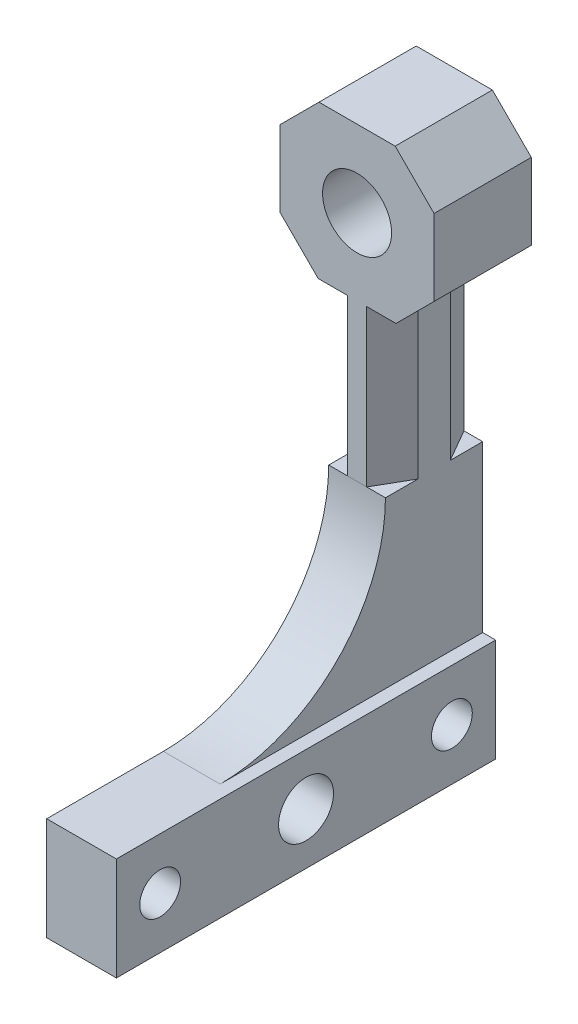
ISO-10303-21;
HEADER;
FILE_DESCRIPTION(('STEP AP214'),'2;1');
FILE_NAME('part.step','',(''),(''),'','','');
FILE_SCHEMA(('AUTOMOTIVE_DESIGN { 1 0 10303 214 1 1 1 1 }'));
ENDSEC;
DATA;
#1=APPLICATION_CONTEXT('core data for automotive mechanical design processes');
#2=APPLICATION_PROTOCOL_DEFINITION('international standard','automotive_design',2000,#1);
#3=PRODUCT_CONTEXT('',#1,'mechanical');
#4=PRODUCT('Part','Part','',(#3));
#5=PRODUCT_RELATED_PRODUCT_CATEGORY('part','',(#4));
#6=PRODUCT_DEFINITION_FORMATION('','',#4);
#7=PRODUCT_DEFINITION_CONTEXT('part definition',#1,'design');
#8=PRODUCT_DEFINITION('design','',#6,#7);
#9=PRODUCT_DEFINITION_SHAPE('','',#8);
#10=(LENGTH_UNIT() NAMED_UNIT(*) SI_UNIT(.MILLI.,.METRE.));
#11=(NAMED_UNIT(*) PLANE_ANGLE_UNIT() SI_UNIT($,.RADIAN.));
#12=(NAMED_UNIT(*) SI_UNIT($,.STERADIAN.) SOLID_ANGLE_UNIT());
#13=UNCERTAINTY_MEASURE_WITH_UNIT(LENGTH_MEASURE(1.E-05),#10,'distance_accuracy_value','');
#14=(GEOMETRIC_REPRESENTATION_CONTEXT(3) GLOBAL_UNCERTAINTY_ASSIGNED_CONTEXT((#13)) GLOBAL_UNIT_ASSIGNED_CONTEXT((#10,
#11,#12)) REPRESENTATION_CONTEXT('',''));
#15=CARTESIAN_POINT('',(0.,0.,0.));
#16=DIRECTION('',(0.,0.,1.));
#17=DIRECTION('',(1.,0.,0.));
#18=AXIS2_PLACEMENT_3D('',#15,#16,#17);
#19=CARTESIAN_POINT('',(2.2225,-31.1658,7.61999999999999));
#20=DIRECTION('',(-1.,0.,0.));
#21=DIRECTION('',(0.,-1.,0.));
#22=AXIS2_PLACEMENT_3D('',#19,#20,#21);
#23=PLANE('',#22);
#24=DIRECTION('',(0.,1.,0.));
#25=VECTOR('',#24,1.);
#26=CARTESIAN_POINT('',(2.2225,-18.2118,2.53999999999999));
#27=LINE('',#26,#25);
#28=CARTESIAN_POINT('',(2.2225,-18.2118,2.53999999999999));
#29=VERTEX_POINT('',#28);
#30=CARTESIAN_POINT('',(2.2225,-5.969,2.53999999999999));
#31=VERTEX_POINT('',#30);
#32=EDGE_CURVE('E236',#29,#31,#27,.T.);
#33=ORIENTED_EDGE('',*,*,#32,.T.);
#34=DIRECTION('',(0.,0.,-1.));
#35=VECTOR('',#34,1.);
#36=CARTESIAN_POINT('',(2.2225,-5.969,2.53999999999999));
#37=LINE('',#36,#35);
#38=CARTESIAN_POINT('',(2.2225,-5.969,5.08));
#39=VERTEX_POINT('',#38);
#40=EDGE_CURVE('E241',#39,#31,#37,.T.);
#41=ORIENTED_EDGE('',*,*,#40,.F.);
#42=DIRECTION('',(0.,1.,0.));
#43=VECTOR('',#42,1.);
#44=CARTESIAN_POINT('',(2.2225,-18.2118,5.08));
#45=LINE('',#44,#43);
#46=CARTESIAN_POINT('',(2.2225,-18.2118,5.08));
#47=VERTEX_POINT('',#46);
#48=EDGE_CURVE('E225',#47,#39,#45,.T.);
#49=ORIENTED_EDGE('',*,*,#48,.F.);
#50=DIRECTION('',(0.,0.,-1.));
#51=VECTOR('',#50,1.);
#52=CARTESIAN_POINT('',(2.2225,-18.2118,7.61999999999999));
#53=LINE('',#52,#51);
#54=CARTESIAN_POINT('',(2.2225,-18.2118,7.62000000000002));
#55=VERTEX_POINT('',#54);
#56=EDGE_CURVE('E288',#55,#47,#53,.T.);
#57=ORIENTED_EDGE('',*,*,#56,.F.);
#58=CARTESIAN_POINT('',(2.2225,-18.2118,20.574));
#59=DIRECTION('',(-1.,0.,0.));
#60=DIRECTION('',(0.,-1.,0.));
#61=AXIS2_PLACEMENT_3D('',#58,#59,#60);
#62=CIRCLE('',#61,12.954);
#63=CARTESIAN_POINT('',(2.2225,-31.1658,20.574));
#64=VERTEX_POINT('',#63);
#65=EDGE_CURVE('E343',#55,#64,#62,.T.);
#66=ORIENTED_EDGE('',*,*,#65,.T.);
#67=DIRECTION('',(0.,0.,1.));
#68=VECTOR('',#67,1.);
#69=CARTESIAN_POINT('',(2.2225,-31.1658,29.718));
#70=LINE('',#69,#68);
#71=CARTESIAN_POINT('',(2.2225,-31.1658,0.));
#72=VERTEX_POINT('',#71);
#73=EDGE_CURVE('E321',#72,#64,#70,.T.);
#74=ORIENTED_EDGE('',*,*,#73,.F.);
#75=DIRECTION('',(0.,1.,0.));
#76=VECTOR('',#75,1.);
#77=CARTESIAN_POINT('',(2.2225,-31.1658,0.));
#78=LINE('',#77,#76);
#79=CARTESIAN_POINT('',(2.2225,-18.2118,0.));
#80=VERTEX_POINT('',#79);
#81=EDGE_CURVE('E399',#72,#80,#78,.T.);
#82=ORIENTED_EDGE('',*,*,#81,.T.);
#83=EDGE_CURVE('E291',#29,#80,#53,.T.);
#84=ORIENTED_EDGE('',*,*,#83,.F.);
#85=EDGE_LOOP('',(#33,#41,#49,#57,#66,#74,#82,#84));
#86=FACE_BOUND('',#85,.T.);
#87=ADVANCED_FACE('F69',(#86),#23,.F.);
#88=CARTESIAN_POINT('',(-2.2225,-6.0325,7.61999999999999));
#89=DIRECTION('',(1.,0.,0.));
#90=DIRECTION('',(0.,1.,0.));
#91=AXIS2_PLACEMENT_3D('',#88,#89,#90);
#92=PLANE('',#91);
#93=DIRECTION('',(0.,1.,0.));
#94=VECTOR('',#93,1.);
#95=CARTESIAN_POINT('',(-2.2225,-18.2118,5.08));
#96=LINE('',#95,#94);
#97=CARTESIAN_POINT('',(-2.2225,-18.2118,5.08));
#98=VERTEX_POINT('',#97);
#99=CARTESIAN_POINT('',(-2.2225,-5.969,5.08));
#100=VERTEX_POINT('',#99);
#101=EDGE_CURVE('E272',#98,#100,#96,.T.);
#102=ORIENTED_EDGE('',*,*,#101,.T.);
#103=DIRECTION('',(0.,0.,1.));
#104=VECTOR('',#103,1.);
#105=CARTESIAN_POINT('',(-2.2225,-5.969,5.08));
#106=LINE('',#105,#104);
#107=CARTESIAN_POINT('',(-2.2225,-5.969,2.53999999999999));
#108=VERTEX_POINT('',#107);
#109=EDGE_CURVE('E254',#108,#100,#106,.T.);
#110=ORIENTED_EDGE('',*,*,#109,.F.);
#111=DIRECTION('',(0.,1.,0.));
#112=VECTOR('',#111,1.);
#113=CARTESIAN_POINT('',(-2.2225,-18.2118,2.54000000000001));
#114=LINE('',#113,#112);
#115=CARTESIAN_POINT('',(-2.2225,-18.2118,2.54000000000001));
#116=VERTEX_POINT('',#115);
#117=EDGE_CURVE('E274',#116,#108,#114,.T.);
#118=ORIENTED_EDGE('',*,*,#117,.F.);
#119=DIRECTION('',(0.,0.,1.));
#120=VECTOR('',#119,1.);
#121=CARTESIAN_POINT('',(-2.2225,-18.2118,7.61999999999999));
#122=LINE('',#121,#120);
#123=CARTESIAN_POINT('',(-2.2225,-18.2118,0.));
#124=VERTEX_POINT('',#123);
#125=EDGE_CURVE('E294',#124,#116,#122,.T.);
#126=ORIENTED_EDGE('',*,*,#125,.F.);
#127=DIRECTION('',(0.,-1.,0.));
#128=VECTOR('',#127,1.);
#129=CARTESIAN_POINT('',(-2.2225,-6.0325,0.));
#130=LINE('',#129,#128);
#131=CARTESIAN_POINT('',(-2.2225,-39.243,0.));
#132=VERTEX_POINT('',#131);
#133=EDGE_CURVE('E396',#124,#132,#130,.T.);
#134=ORIENTED_EDGE('',*,*,#133,.T.);
#135=DIRECTION('',(0.,0.,-1.));
#136=VECTOR('',#135,1.);
#137=CARTESIAN_POINT('',(-2.2225,-39.243,29.718));
#138=LINE('',#137,#136);
#139=CARTESIAN_POINT('',(-2.2225,-39.243,29.718));
#140=VERTEX_POINT('',#139);
#141=EDGE_CURVE('E572',#140,#132,#138,.T.);
#142=ORIENTED_EDGE('',*,*,#141,.F.);
#143=DIRECTION('',(0.,-1.,0.));
#144=VECTOR('',#143,1.);
#145=CARTESIAN_POINT('',(-2.2225,-31.1658,29.718));
#146=LINE('',#145,#144);
#147=CARTESIAN_POINT('',(-2.2225,-31.1658,29.718));
#148=VERTEX_POINT('',#147);
#149=EDGE_CURVE('E333',#148,#140,#146,.T.);
#150=ORIENTED_EDGE('',*,*,#149,.F.);
#151=DIRECTION('',(0.,0.,1.));
#152=VECTOR('',#151,1.);
#153=CARTESIAN_POINT('',(-2.2225,-31.1658,29.718));
#154=LINE('',#153,#152);
#155=CARTESIAN_POINT('',(-2.2225,-31.1658,20.574));
#156=VERTEX_POINT('',#155);
#157=EDGE_CURVE('E336',#156,#148,#154,.T.);
#158=ORIENTED_EDGE('',*,*,#157,.F.);
#159=CARTESIAN_POINT('',(-2.2225,-18.2118,20.574));
#160=DIRECTION('',(1.,0.,0.));
#161=DIRECTION('',(0.,1.,0.));
#162=AXIS2_PLACEMENT_3D('',#159,#160,#161);
#163=CIRCLE('',#162,12.954);
#164=CARTESIAN_POINT('',(-2.2225,-18.2118,7.62000000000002));
#165=VERTEX_POINT('',#164);
#166=EDGE_CURVE('E346',#156,#165,#163,.T.);
#167=ORIENTED_EDGE('',*,*,#166,.T.);
#168=EDGE_CURVE('E290',#98,#165,#122,.T.);
#169=ORIENTED_EDGE('',*,*,#168,.F.);
#170=EDGE_LOOP('',(#102,#110,#118,#126,#134,#142,#150,#158,#167,#169));
#171=FACE_BOUND('',#170,.T.);
#172=CARTESIAN_POINT('',(-2.2225,-35.2044,26.289));
#173=DIRECTION('',(1.,0.,0.));
#174=DIRECTION('',(0.,1.,0.));
#175=AXIS2_PLACEMENT_3D('',#172,#173,#174);
#176=CIRCLE('',#175,1.6002);
#177=CARTESIAN_POINT('',(-2.2225,-33.6042,26.289));
#178=VERTEX_POINT('',#177);
#179=EDGE_CURVE('E300',#178,#178,#176,.T.);
#180=ORIENTED_EDGE('',*,*,#179,.T.);
#181=EDGE_LOOP('',(#180));
#182=FACE_BOUND('',#181,.T.);
#183=CARTESIAN_POINT('',(-2.2225,-35.2044,3.42900000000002));
#184=DIRECTION('',(1.,0.,0.));
#185=DIRECTION('',(0.,1.,0.));
#186=AXIS2_PLACEMENT_3D('',#183,#184,#185);
#187=CIRCLE('',#186,1.6002);
#188=CARTESIAN_POINT('',(-2.2225,-33.6042,3.42900000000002));
#189=VERTEX_POINT('',#188);
#190=EDGE_CURVE('E306',#189,#189,#187,.T.);
#191=ORIENTED_EDGE('',*,*,#190,.T.);
#192=EDGE_LOOP('',(#191));
#193=FACE_BOUND('',#192,.T.);
#194=CARTESIAN_POINT('',(-2.2225,-35.2044,14.859));
#195=DIRECTION('',(1.,0.,0.));
#196=DIRECTION('',(0.,1.,0.));
#197=AXIS2_PLACEMENT_3D('',#194,#195,#196);
#198=CIRCLE('',#197,2.15265);
#199=CARTESIAN_POINT('',(-2.2225,-33.05175,14.859));
#200=VERTEX_POINT('',#199);
#201=EDGE_CURVE('E318',#200,#200,#198,.T.);
#202=ORIENTED_EDGE('',*,*,#201,.T.);
#203=EDGE_LOOP('',(#202));
#204=FACE_BOUND('',#203,.T.);
#205=ADVANCED_FACE('F461',(#171,#182,#193,#204),#92,.F.);
#206=CARTESIAN_POINT('',(-6.0325,6.0325,0.));
#207=DIRECTION('',(0.,0.,1.));
#208=DIRECTION('',(1.,0.,0.));
#209=AXIS2_PLACEMENT_3D('',#206,#207,#208);
#210=PLANE('',#209);
#211=DIRECTION('',(0.,1.,0.));
#212=VECTOR('',#211,1.);
#213=CARTESIAN_POINT('',(-0.756030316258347,-18.2118,0.));
#214=LINE('',#213,#212);
#215=CARTESIAN_POINT('',(-0.756030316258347,-18.2118,0.));
#216=VERTEX_POINT('',#215);
#217=CARTESIAN_POINT('',(-0.756030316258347,-5.969,0.));
#218=VERTEX_POINT('',#217);
#219=EDGE_CURVE('E276',#216,#218,#214,.T.);
#220=ORIENTED_EDGE('',*,*,#219,.T.);
#221=DIRECTION('',(-1.,0.,0.));
#222=VECTOR('',#221,1.);
#223=CARTESIAN_POINT('',(-6.0325,-5.969,0.));
#224=LINE('',#223,#222);
#225=CARTESIAN_POINT('',(-3.048,-5.969,0.));
#226=VERTEX_POINT('',#225);
#227=EDGE_CURVE('E271',#218,#226,#224,.T.);
#228=ORIENTED_EDGE('',*,*,#227,.T.);
#229=DIRECTION('',(0.707106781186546,-0.707106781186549,0.));
#230=VECTOR('',#229,1.);
#231=CARTESIAN_POINT('',(-2.9845,-6.0325,0.));
#232=LINE('',#231,#230);
#233=CARTESIAN_POINT('',(-6.0325,-2.98449999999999,0.));
#234=VERTEX_POINT('',#233);
#235=EDGE_CURVE('E354',#226,#234,#232,.F.);
#236=ORIENTED_EDGE('',*,*,#235,.T.);
#237=DIRECTION('',(0.,-1.,0.));
#238=VECTOR('',#237,1.);
#239=CARTESIAN_POINT('',(-6.0325,6.0325,0.));
#240=LINE('',#239,#238);
#241=CARTESIAN_POINT('',(-6.0325,2.9845,0.));
#242=VERTEX_POINT('',#241);
#243=EDGE_CURVE('E384',#242,#234,#240,.T.);
#244=ORIENTED_EDGE('',*,*,#243,.F.);
#245=DIRECTION('',(-0.707106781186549,-0.707106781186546,0.));
#246=VECTOR('',#245,1.);
#247=CARTESIAN_POINT('',(-6.0325,2.9845,0.));
#248=LINE('',#247,#246);
#249=CARTESIAN_POINT('',(-2.98449999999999,6.0325,0.));
#250=VERTEX_POINT('',#249);
#251=EDGE_CURVE('E356',#242,#250,#248,.F.);
#252=ORIENTED_EDGE('',*,*,#251,.T.);
#253=DIRECTION('',(-1.,0.,0.));
#254=VECTOR('',#253,1.);
#255=CARTESIAN_POINT('',(-6.0325,6.0325,0.));
#256=LINE('',#255,#254);
#257=CARTESIAN_POINT('',(2.9845,6.0325,0.));
#258=VERTEX_POINT('',#257);
#259=EDGE_CURVE('E411',#258,#250,#256,.T.);
#260=ORIENTED_EDGE('',*,*,#259,.F.);
#261=DIRECTION('',(-0.707106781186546,0.707106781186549,0.));
#262=VECTOR('',#261,1.);
#263=CARTESIAN_POINT('',(2.9845,6.0325,0.));
#264=LINE('',#263,#262);
#265=CARTESIAN_POINT('',(6.0325,2.98449999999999,0.));
#266=VERTEX_POINT('',#265);
#267=EDGE_CURVE('E358',#258,#266,#264,.F.);
#268=ORIENTED_EDGE('',*,*,#267,.T.);
#269=DIRECTION('',(0.,1.,0.));
#270=VECTOR('',#269,1.);
#271=CARTESIAN_POINT('',(6.0325,6.0325,0.));
#272=LINE('',#271,#270);
#273=CARTESIAN_POINT('',(6.0325,-2.9845,0.));
#274=VERTEX_POINT('',#273);
#275=EDGE_CURVE('E408',#274,#266,#272,.T.);
#276=ORIENTED_EDGE('',*,*,#275,.F.);
#277=DIRECTION('',(0.707106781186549,0.707106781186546,0.));
#278=VECTOR('',#277,1.);
#279=CARTESIAN_POINT('',(6.0325,-2.9845,0.));
#280=LINE('',#279,#278);
#281=CARTESIAN_POINT('',(3.04799999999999,-5.969,0.));
#282=VERTEX_POINT('',#281);
#283=EDGE_CURVE('E360',#274,#282,#280,.F.);
#284=ORIENTED_EDGE('',*,*,#283,.T.);
#285=CARTESIAN_POINT('',(0.75603031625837,-5.969,0.));
#286=VERTEX_POINT('',#285);
#287=EDGE_CURVE('E84',#282,#286,#224,.T.);
#288=ORIENTED_EDGE('',*,*,#287,.T.);
#289=DIRECTION('',(0.,1.,0.));
#290=VECTOR('',#289,1.);
#291=CARTESIAN_POINT('',(0.75603031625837,-18.2118,0.));
#292=LINE('',#291,#290);
#293=CARTESIAN_POINT('',(0.75603031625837,-18.2118,0.));
#294=VERTEX_POINT('',#293);
#295=EDGE_CURVE('E279',#294,#286,#292,.T.);
#296=ORIENTED_EDGE('',*,*,#295,.F.);
#297=DIRECTION('',(-1.,0.,0.));
#298=VECTOR('',#297,1.);
#299=CARTESIAN_POINT('',(-6.0325,-18.2118,0.));
#300=LINE('',#299,#298);
#301=EDGE_CURVE('E296',#80,#294,#300,.T.);
#302=ORIENTED_EDGE('',*,*,#301,.F.);
#303=ORIENTED_EDGE('',*,*,#81,.F.);
#304=DIRECTION('',(-1.,0.,0.));
#305=VECTOR('',#304,1.);
#306=CARTESIAN_POINT('',(3.2385,-31.1658,0.));
#307=LINE('',#306,#305);
#308=CARTESIAN_POINT('',(3.2385,-31.1658,0.));
#309=VERTEX_POINT('',#308);
#310=EDGE_CURVE('E329',#309,#72,#307,.T.);
#311=ORIENTED_EDGE('',*,*,#310,.F.);
#312=DIRECTION('',(0.,1.,0.));
#313=VECTOR('',#312,1.);
#314=CARTESIAN_POINT('',(3.2385,-39.243,0.));
#315=LINE('',#314,#313);
#316=CARTESIAN_POINT('',(3.2385,-39.243,0.));
#317=VERTEX_POINT('',#316);
#318=EDGE_CURVE('E552',#317,#309,#315,.T.);
#319=ORIENTED_EDGE('',*,*,#318,.F.);
#320=DIRECTION('',(-1.,0.,0.));
#321=VECTOR('',#320,1.);
#322=CARTESIAN_POINT('',(33.0186147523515,-39.243,0.));
#323=LINE('',#322,#321);
#324=EDGE_CURVE('E568',#317,#132,#323,.T.);
#325=ORIENTED_EDGE('',*,*,#324,.T.);
#326=ORIENTED_EDGE('',*,*,#133,.F.);
#327=EDGE_CURVE('E293',#216,#124,#300,.T.);
#328=ORIENTED_EDGE('',*,*,#327,.F.);
#329=EDGE_LOOP('',(#220,#228,#236,#244,#252,#260,#268,#276,#284,#288,#296,#302,#303,#311,#319,
#325,#326,#328));
#330=FACE_BOUND('',#329,.T.);
#331=CARTESIAN_POINT('',(0.,0.,0.));
#332=DIRECTION('',(0.,0.,-1.));
#333=DIRECTION('',(-1.,0.,0.));
#334=AXIS2_PLACEMENT_3D('',#331,#332,#333);
#335=CIRCLE('',#334,2.70509999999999);
#336=CARTESIAN_POINT('',(-2.70509999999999,0.,0.));
#337=VERTEX_POINT('',#336);
#338=EDGE_CURVE('E309',#337,#337,#335,.T.);
#339=ORIENTED_EDGE('',*,*,#338,.F.);
#340=EDGE_LOOP('',(#339));
#341=FACE_BOUND('',#340,.T.);
#342=ADVANCED_FACE('F391',(#330,#341),#210,.F.);
#343=CARTESIAN_POINT('',(-6.0325,6.0325,7.61999999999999));
#344=DIRECTION('',(1.,0.,0.));
#345=DIRECTION('',(0.,1.,0.));
#346=AXIS2_PLACEMENT_3D('',#343,#344,#345);
#347=PLANE('',#346);
#348=DIRECTION('',(0.,-1.,0.));
#349=VECTOR('',#348,1.);
#350=CARTESIAN_POINT('',(-6.0325,6.0325,7.61999999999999));
#351=LINE('',#350,#349);
#352=CARTESIAN_POINT('',(-6.0325,2.9845,7.61999999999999));
#353=VERTEX_POINT('',#352);
#354=CARTESIAN_POINT('',(-6.0325,-2.98449999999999,7.61999999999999));
#355=VERTEX_POINT('',#354);
#356=EDGE_CURVE('E387',#353,#355,#351,.T.);
#357=ORIENTED_EDGE('',*,*,#356,.F.);
#358=DIRECTION('',(0.,0.,-1.));
#359=VECTOR('',#358,1.);
#360=CARTESIAN_POINT('',(-6.0325,2.9845,7.61999999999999));
#361=LINE('',#360,#359);
#362=EDGE_CURVE('E77',#353,#242,#361,.T.);
#363=ORIENTED_EDGE('',*,*,#362,.T.);
#364=ORIENTED_EDGE('',*,*,#243,.T.);
#365=DIRECTION('',(0.,0.,1.));
#366=VECTOR('',#365,1.);
#367=CARTESIAN_POINT('',(-6.0325,-2.98449999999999,7.61999999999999));
#368=LINE('',#367,#366);
#369=EDGE_CURVE('E377',#234,#355,#368,.T.);
#370=ORIENTED_EDGE('',*,*,#369,.T.);
#371=EDGE_LOOP('',(#357,#363,#364,#370));
#372=FACE_BOUND('',#371,.T.);
#373=ADVANCED_FACE('F71',(#372),#347,.F.);
#374=CARTESIAN_POINT('',(6.0325,6.0325,7.61999999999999));
#375=DIRECTION('',(-1.,0.,0.));
#376=DIRECTION('',(0.,-1.,0.));
#377=AXIS2_PLACEMENT_3D('',#374,#375,#376);
#378=PLANE('',#377);
#379=DIRECTION('',(0.,1.,0.));
#380=VECTOR('',#379,1.);
#381=CARTESIAN_POINT('',(6.0325,6.0325,7.61999999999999));
#382=LINE('',#381,#380);
#383=CARTESIAN_POINT('',(6.0325,-2.9845,7.61999999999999));
#384=VERTEX_POINT('',#383);
#385=CARTESIAN_POINT('',(6.0325,2.98449999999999,7.61999999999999));
#386=VERTEX_POINT('',#385);
#387=EDGE_CURVE('E414',#384,#386,#382,.T.);
#388=ORIENTED_EDGE('',*,*,#387,.F.);
#389=DIRECTION('',(0.,0.,-1.));
#390=VECTOR('',#389,1.);
#391=CARTESIAN_POINT('',(6.0325,-2.9845,7.61999999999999));
#392=LINE('',#391,#390);
#393=EDGE_CURVE('E351',#384,#274,#392,.T.);
#394=ORIENTED_EDGE('',*,*,#393,.T.);
#395=ORIENTED_EDGE('',*,*,#275,.T.);
#396=DIRECTION('',(0.,0.,1.));
#397=VECTOR('',#396,1.);
#398=CARTESIAN_POINT('',(6.0325,2.98449999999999,7.61999999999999));
#399=LINE('',#398,#397);
#400=EDGE_CURVE('E349',#266,#386,#399,.T.);
#401=ORIENTED_EDGE('',*,*,#400,.T.);
#402=EDGE_LOOP('',(#388,#394,#395,#401));
#403=FACE_BOUND('',#402,.T.);
#404=ADVANCED_FACE('F468',(#403),#378,.F.);
#405=CARTESIAN_POINT('',(-6.0325,6.0325,7.61999999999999));
#406=DIRECTION('',(0.,-1.,0.));
#407=DIRECTION('',(0.,0.,-1.));
#408=AXIS2_PLACEMENT_3D('',#405,#406,#407);
#409=PLANE('',#408);
#410=DIRECTION('',(-1.,0.,0.));
#411=VECTOR('',#410,1.);
#412=CARTESIAN_POINT('',(-6.0325,6.0325,7.61999999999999));
#413=LINE('',#412,#411);
#414=CARTESIAN_POINT('',(2.9845,6.0325,7.61999999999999));
#415=VERTEX_POINT('',#414);
#416=CARTESIAN_POINT('',(-2.98449999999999,6.0325,7.61999999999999));
#417=VERTEX_POINT('',#416);
#418=EDGE_CURVE('E416',#415,#417,#413,.T.);
#419=ORIENTED_EDGE('',*,*,#418,.F.);
#420=DIRECTION('',(0.,0.,-1.));
#421=VECTOR('',#420,1.);
#422=CARTESIAN_POINT('',(2.9845,6.0325,7.61999999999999));
#423=LINE('',#422,#421);
#424=EDGE_CURVE('E374',#415,#258,#423,.T.);
#425=ORIENTED_EDGE('',*,*,#424,.T.);
#426=ORIENTED_EDGE('',*,*,#259,.T.);
#427=DIRECTION('',(0.,0.,1.));
#428=VECTOR('',#427,1.);
#429=CARTESIAN_POINT('',(-2.98449999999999,6.0325,7.61999999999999));
#430=LINE('',#429,#428);
#431=EDGE_CURVE('E372',#250,#417,#430,.T.);
#432=ORIENTED_EDGE('',*,*,#431,.T.);
#433=EDGE_LOOP('',(#419,#425,#426,#432));
#434=FACE_BOUND('',#433,.T.);
#435=ADVANCED_FACE('F471',(#434),#409,.F.);
#436=CARTESIAN_POINT('',(-6.0325,6.0325,7.61999999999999));
#437=DIRECTION('',(0.,0.,1.));
#438=DIRECTION('',(1.,0.,0.));
#439=AXIS2_PLACEMENT_3D('',#436,#437,#438);
#440=PLANE('',#439);
#441=DIRECTION('',(-1.,0.,0.));
#442=VECTOR('',#441,1.);
#443=CARTESIAN_POINT('',(-6.0325,-5.969,7.61999999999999));
#444=LINE('',#443,#442);
#445=CARTESIAN_POINT('',(3.04799999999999,-5.969,7.61999999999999));
#446=VERTEX_POINT('',#445);
#447=CARTESIAN_POINT('',(0.756030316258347,-5.969,7.61999999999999));
#448=VERTEX_POINT('',#447);
#449=EDGE_CURVE('E244',#446,#448,#444,.T.);
#450=ORIENTED_EDGE('',*,*,#449,.F.);
#451=DIRECTION('',(-0.707106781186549,-0.707106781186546,0.));
#452=VECTOR('',#451,1.);
#453=CARTESIAN_POINT('',(4.50849999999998,-4.50850000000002,7.61999999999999));
#454=LINE('',#453,#452);
#455=EDGE_CURVE('E370',#446,#384,#454,.F.);
#456=ORIENTED_EDGE('',*,*,#455,.T.);
#457=ORIENTED_EDGE('',*,*,#387,.T.);
#458=DIRECTION('',(0.707106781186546,-0.707106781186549,0.));
#459=VECTOR('',#458,1.);
#460=CARTESIAN_POINT('',(-1.52399999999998,10.541,7.61999999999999));
#461=LINE('',#460,#459);
#462=EDGE_CURVE('E368',#386,#415,#461,.F.);
#463=ORIENTED_EDGE('',*,*,#462,.T.);
#464=ORIENTED_EDGE('',*,*,#418,.T.);
#465=DIRECTION('',(0.707106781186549,0.707106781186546,0.));
#466=VECTOR('',#465,1.);
#467=CARTESIAN_POINT('',(-4.5085,4.50849999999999,7.61999999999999));
#468=LINE('',#467,#466);
#469=EDGE_CURVE('E366',#417,#353,#468,.F.);
#470=ORIENTED_EDGE('',*,*,#469,.T.);
#471=ORIENTED_EDGE('',*,*,#356,.T.);
#472=DIRECTION('',(-0.707106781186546,0.707106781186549,0.));
#473=VECTOR('',#472,1.);
#474=CARTESIAN_POINT('',(-10.541,1.52400000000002,7.62000000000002));
#475=LINE('',#474,#473);
#476=CARTESIAN_POINT('',(-3.048,-5.969,7.61999999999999));
#477=VERTEX_POINT('',#476);
#478=EDGE_CURVE('E363',#355,#477,#475,.F.);
#479=ORIENTED_EDGE('',*,*,#478,.T.);
#480=CARTESIAN_POINT('',(-0.75603031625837,-5.969,7.61999999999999));
#481=VERTEX_POINT('',#480);
#482=EDGE_CURVE('E91',#481,#477,#444,.T.);
#483=ORIENTED_EDGE('',*,*,#482,.F.);
#484=DIRECTION('',(0.,1.,0.));
#485=VECTOR('',#484,1.);
#486=CARTESIAN_POINT('',(-0.75603031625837,-18.2118,7.61999999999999));
#487=LINE('',#486,#485);
#488=CARTESIAN_POINT('',(-0.75603031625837,-18.2118,7.61999999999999));
#489=VERTEX_POINT('',#488);
#490=EDGE_CURVE('E269',#489,#481,#487,.T.);
#491=ORIENTED_EDGE('',*,*,#490,.F.);
#492=DIRECTION('',(1.,0.,0.));
#493=VECTOR('',#492,1.);
#494=CARTESIAN_POINT('',(-6.0325,-18.2118,7.62000000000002));
#495=LINE('',#494,#493);
#496=CARTESIAN_POINT('',(0.756030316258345,-18.2118,7.61999999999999));
#497=VERTEX_POINT('',#496);
#498=EDGE_CURVE('E421',#489,#497,#495,.T.);
#499=ORIENTED_EDGE('',*,*,#498,.T.);
#500=DIRECTION('',(0.,1.,0.));
#501=VECTOR('',#500,1.);
#502=CARTESIAN_POINT('',(0.756030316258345,-18.2118,7.61999999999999));
#503=LINE('',#502,#501);
#504=EDGE_CURVE('E237',#497,#448,#503,.T.);
#505=ORIENTED_EDGE('',*,*,#504,.T.);
#506=EDGE_LOOP('',(#450,#456,#457,#463,#464,#470,#471,#479,#483,#491,#499,#505));
#507=FACE_BOUND('',#506,.T.);
#508=CARTESIAN_POINT('',(0.,0.,7.61999999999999));
#509=DIRECTION('',(0.,0.,1.));
#510=DIRECTION('',(1.,0.,0.));
#511=AXIS2_PLACEMENT_3D('',#508,#509,#510);
#512=CIRCLE('',#511,2.70509999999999);
#513=CARTESIAN_POINT('',(2.70509999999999,0.,7.61999999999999));
#514=VERTEX_POINT('',#513);
#515=EDGE_CURVE('E312',#514,#514,#512,.T.);
#516=ORIENTED_EDGE('',*,*,#515,.F.);
#517=EDGE_LOOP('',(#516));
#518=FACE_BOUND('',#517,.T.);
#519=ADVANCED_FACE('F437',(#507,#518),#440,.T.);
#520=CARTESIAN_POINT('',(33.0186147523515,-39.243,29.718));
#521=DIRECTION('',(0.,1.,0.));
#522=DIRECTION('',(0.,0.,1.));
#523=AXIS2_PLACEMENT_3D('',#520,#521,#522);
#524=PLANE('',#523);
#525=ORIENTED_EDGE('',*,*,#324,.F.);
#526=DIRECTION('',(0.,0.,-1.));
#527=VECTOR('',#526,1.);
#528=CARTESIAN_POINT('',(3.2385,-39.243,29.718));
#529=LINE('',#528,#527);
#530=CARTESIAN_POINT('',(3.2385,-39.243,29.718));
#531=VERTEX_POINT('',#530);
#532=EDGE_CURVE('E548',#531,#317,#529,.T.);
#533=ORIENTED_EDGE('',*,*,#532,.F.);
#534=DIRECTION('',(-1.,0.,0.));
#535=VECTOR('',#534,1.);
#536=CARTESIAN_POINT('',(33.0186147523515,-39.243,29.718));
#537=LINE('',#536,#535);
#538=EDGE_CURVE('E402',#531,#140,#537,.T.);
#539=ORIENTED_EDGE('',*,*,#538,.T.);
#540=ORIENTED_EDGE('',*,*,#141,.T.);
#541=EDGE_LOOP('',(#525,#533,#539,#540));
#542=FACE_BOUND('',#541,.T.);
#543=ADVANCED_FACE('F478',(#542),#524,.F.);
#544=CARTESIAN_POINT('',(33.0186147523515,-31.1658,29.718));
#545=DIRECTION('',(0.,0.,-1.));
#546=DIRECTION('',(-1.,0.,0.));
#547=AXIS2_PLACEMENT_3D('',#544,#545,#546);
#548=PLANE('',#547);
#549=ORIENTED_EDGE('',*,*,#538,.F.);
#550=DIRECTION('',(0.,-1.,0.));
#551=VECTOR('',#550,1.);
#552=CARTESIAN_POINT('',(3.2385,-39.243,29.718));
#553=LINE('',#552,#551);
#554=CARTESIAN_POINT('',(3.2385,-31.1658,29.718));
#555=VERTEX_POINT('',#554);
#556=EDGE_CURVE('E324',#555,#531,#553,.T.);
#557=ORIENTED_EDGE('',*,*,#556,.F.);
#558=DIRECTION('',(-1.,0.,0.));
#559=VECTOR('',#558,1.);
#560=CARTESIAN_POINT('',(33.0186147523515,-31.1658,29.718));
#561=LINE('',#560,#559);
#562=EDGE_CURVE('E397',#555,#148,#561,.T.);
#563=ORIENTED_EDGE('',*,*,#562,.T.);
#564=ORIENTED_EDGE('',*,*,#149,.T.);
#565=EDGE_LOOP('',(#549,#557,#563,#564));
#566=FACE_BOUND('',#565,.T.);
#567=ADVANCED_FACE('F485',(#566),#548,.F.);
#568=CARTESIAN_POINT('',(33.0186147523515,-31.1658,29.718));
#569=DIRECTION('',(0.,-1.,0.));
#570=DIRECTION('',(0.,0.,-1.));
#571=AXIS2_PLACEMENT_3D('',#568,#569,#570);
#572=PLANE('',#571);
#573=ORIENTED_EDGE('',*,*,#73,.T.);
#574=DIRECTION('',(1.,0.,0.));
#575=VECTOR('',#574,1.);
#576=CARTESIAN_POINT('',(33.0186147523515,-31.1658,20.574));
#577=LINE('',#576,#575);
#578=EDGE_CURVE('E341',#64,#156,#577,.F.);
#579=ORIENTED_EDGE('',*,*,#578,.T.);
#580=ORIENTED_EDGE('',*,*,#157,.T.);
#581=ORIENTED_EDGE('',*,*,#562,.F.);
#582=DIRECTION('',(0.,0.,1.));
#583=VECTOR('',#582,1.);
#584=CARTESIAN_POINT('',(3.2385,-31.1658,29.718));
#585=LINE('',#584,#583);
#586=EDGE_CURVE('E551',#309,#555,#585,.T.);
#587=ORIENTED_EDGE('',*,*,#586,.F.);
#588=ORIENTED_EDGE('',*,*,#310,.T.);
#589=EDGE_LOOP('',(#573,#579,#580,#581,#587,#588));
#590=FACE_BOUND('',#589,.T.);
#591=ADVANCED_FACE('F481',(#590),#572,.F.);
#592=CARTESIAN_POINT('',(3.2385,-31.1658,29.718));
#593=DIRECTION('',(-1.,0.,0.));
#594=DIRECTION('',(0.,-1.,0.));
#595=AXIS2_PLACEMENT_3D('',#592,#593,#594);
#596=PLANE('',#595);
#597=CARTESIAN_POINT('',(3.2385,-35.2044,26.289));
#598=DIRECTION('',(1.,0.,0.));
#599=DIRECTION('',(0.,0.,-1.));
#600=AXIS2_PLACEMENT_3D('',#597,#598,#599);
#601=CIRCLE('',#600,1.6002);
#602=CARTESIAN_POINT('',(3.2385,-35.2044,24.6888));
#603=VERTEX_POINT('',#602);
#604=EDGE_CURVE('E297',#603,#603,#601,.T.);
#605=ORIENTED_EDGE('',*,*,#604,.F.);
#606=EDGE_LOOP('',(#605));
#607=FACE_BOUND('',#606,.T.);
#608=CARTESIAN_POINT('',(3.2385,-35.2044,3.42900000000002));
#609=DIRECTION('',(1.,0.,0.));
#610=DIRECTION('',(0.,0.,-1.));
#611=AXIS2_PLACEMENT_3D('',#608,#609,#610);
#612=CIRCLE('',#611,1.6002);
#613=CARTESIAN_POINT('',(3.2385,-35.2044,1.82880000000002));
#614=VERTEX_POINT('',#613);
#615=EDGE_CURVE('E303',#614,#614,#612,.T.);
#616=ORIENTED_EDGE('',*,*,#615,.F.);
#617=EDGE_LOOP('',(#616));
#618=FACE_BOUND('',#617,.T.);
#619=CARTESIAN_POINT('',(3.2385,-35.2044,14.859));
#620=DIRECTION('',(1.,0.,0.));
#621=DIRECTION('',(0.,0.,-1.));
#622=AXIS2_PLACEMENT_3D('',#619,#620,#621);
#623=CIRCLE('',#622,2.15264999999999);
#624=CARTESIAN_POINT('',(3.2385,-35.2044,12.70635));
#625=VERTEX_POINT('',#624);
#626=EDGE_CURVE('E315',#625,#625,#623,.T.);
#627=ORIENTED_EDGE('',*,*,#626,.F.);
#628=EDGE_LOOP('',(#627));
#629=FACE_BOUND('',#628,.T.);
#630=ORIENTED_EDGE('',*,*,#556,.T.);
#631=ORIENTED_EDGE('',*,*,#532,.T.);
#632=ORIENTED_EDGE('',*,*,#318,.T.);
#633=ORIENTED_EDGE('',*,*,#586,.T.);
#634=EDGE_LOOP('',(#630,#631,#632,#633));
#635=FACE_BOUND('',#634,.T.);
#636=ADVANCED_FACE('F484',(#607,#618,#629,#635),#596,.F.);
#637=CARTESIAN_POINT('',(-6.0325,-18.2118,20.574));
#638=DIRECTION('',(1.,0.,0.));
#639=DIRECTION('',(0.,0.,-1.));
#640=AXIS2_PLACEMENT_3D('',#637,#638,#639);
#641=CYLINDRICAL_SURFACE('',#640,12.954);
#642=ORIENTED_EDGE('',*,*,#166,.F.);
#643=ORIENTED_EDGE('',*,*,#578,.F.);
#644=ORIENTED_EDGE('',*,*,#65,.F.);
#645=EDGE_CURVE('E418',#497,#55,#495,.T.);
#646=ORIENTED_EDGE('',*,*,#645,.F.);
#647=ORIENTED_EDGE('',*,*,#498,.F.);
#648=EDGE_CURVE('E339',#165,#489,#495,.T.);
#649=ORIENTED_EDGE('',*,*,#648,.F.);
#650=EDGE_LOOP('',(#642,#643,#644,#646,#647,#649));
#651=FACE_BOUND('',#650,.T.);
#652=ADVANCED_FACE('F439',(#651),#641,.F.);
#653=CARTESIAN_POINT('',(3.2385,-35.2044,14.859));
#654=DIRECTION('',(1.,0.,0.));
#655=DIRECTION('',(0.,0.,-1.));
#656=AXIS2_PLACEMENT_3D('',#653,#654,#655);
#657=CYLINDRICAL_SURFACE('',#656,2.15265);
#658=ORIENTED_EDGE('',*,*,#626,.T.);
#659=EDGE_LOOP('',(#658));
#660=FACE_BOUND('',#659,.T.);
#661=ORIENTED_EDGE('',*,*,#201,.F.);
#662=EDGE_LOOP('',(#661));
#663=FACE_BOUND('',#662,.T.);
#664=ADVANCED_FACE('F498',(#660,#663),#657,.F.);
#665=CARTESIAN_POINT('',(0.,0.,0.));
#666=DIRECTION('',(0.,0.,-1.));
#667=DIRECTION('',(-1.,0.,0.));
#668=AXIS2_PLACEMENT_3D('',#665,#666,#667);
#669=CYLINDRICAL_SURFACE('',#668,2.70509999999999);
#670=ORIENTED_EDGE('',*,*,#515,.T.);
#671=EDGE_LOOP('',(#670));
#672=FACE_BOUND('',#671,.T.);
#673=ORIENTED_EDGE('',*,*,#338,.T.);
#674=EDGE_LOOP('',(#673));
#675=FACE_BOUND('',#674,.T.);
#676=ADVANCED_FACE('F501',(#672,#675),#669,.F.);
#677=CARTESIAN_POINT('',(6.0325,-2.9845,7.61999999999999));
#678=DIRECTION('',(-0.707106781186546,0.707106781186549,0.));
#679=DIRECTION('',(-0.707106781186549,-0.707106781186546,0.));
#680=AXIS2_PLACEMENT_3D('',#677,#678,#679);
#681=PLANE('',#680);
#682=DIRECTION('',(0.,0.,-1.));
#683=VECTOR('',#682,1.);
#684=CARTESIAN_POINT('',(3.04799999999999,-5.969,7.61999999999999));
#685=LINE('',#684,#683);
#686=EDGE_CURVE('E286',#282,#446,#685,.F.);
#687=ORIENTED_EDGE('',*,*,#686,.F.);
#688=ORIENTED_EDGE('',*,*,#283,.F.);
#689=ORIENTED_EDGE('',*,*,#393,.F.);
#690=ORIENTED_EDGE('',*,*,#455,.F.);
#691=EDGE_LOOP('',(#687,#688,#689,#690));
#692=FACE_BOUND('',#691,.T.);
#693=ADVANCED_FACE('F505',(#692),#681,.F.);
#694=CARTESIAN_POINT('',(2.9845,6.0325,7.61999999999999));
#695=DIRECTION('',(-0.707106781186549,-0.707106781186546,0.));
#696=DIRECTION('',(0.707106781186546,-0.707106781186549,0.));
#697=AXIS2_PLACEMENT_3D('',#694,#695,#696);
#698=PLANE('',#697);
#699=ORIENTED_EDGE('',*,*,#462,.F.);
#700=ORIENTED_EDGE('',*,*,#400,.F.);
#701=ORIENTED_EDGE('',*,*,#267,.F.);
#702=ORIENTED_EDGE('',*,*,#424,.F.);
#703=EDGE_LOOP('',(#699,#700,#701,#702));
#704=FACE_BOUND('',#703,.T.);
#705=ADVANCED_FACE('F509',(#704),#698,.F.);
#706=CARTESIAN_POINT('',(-6.0325,2.9845,7.61999999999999));
#707=DIRECTION('',(0.707106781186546,-0.707106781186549,0.));
#708=DIRECTION('',(0.707106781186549,0.707106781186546,0.));
#709=AXIS2_PLACEMENT_3D('',#706,#707,#708);
#710=PLANE('',#709);
#711=ORIENTED_EDGE('',*,*,#469,.F.);
#712=ORIENTED_EDGE('',*,*,#431,.F.);
#713=ORIENTED_EDGE('',*,*,#251,.F.);
#714=ORIENTED_EDGE('',*,*,#362,.F.);
#715=EDGE_LOOP('',(#711,#712,#713,#714));
#716=FACE_BOUND('',#715,.T.);
#717=ADVANCED_FACE('F513',(#716),#710,.F.);
#718=CARTESIAN_POINT('',(-2.9845,-6.0325,7.61999999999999));
#719=DIRECTION('',(0.707106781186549,0.707106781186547,0.));
#720=DIRECTION('',(-0.707106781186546,0.707106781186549,0.));
#721=AXIS2_PLACEMENT_3D('',#718,#719,#720);
#722=PLANE('',#721);
#723=DIRECTION('',(0.,0.,1.));
#724=VECTOR('',#723,1.);
#725=CARTESIAN_POINT('',(-3.048,-5.969,7.61999999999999));
#726=LINE('',#725,#724);
#727=EDGE_CURVE('E13',#477,#226,#726,.F.);
#728=ORIENTED_EDGE('',*,*,#727,.F.);
#729=ORIENTED_EDGE('',*,*,#478,.F.);
#730=ORIENTED_EDGE('',*,*,#369,.F.);
#731=ORIENTED_EDGE('',*,*,#235,.F.);
#732=EDGE_LOOP('',(#728,#729,#730,#731));
#733=FACE_BOUND('',#732,.T.);
#734=ADVANCED_FACE('F517',(#733),#722,.F.);
#735=CARTESIAN_POINT('',(3.2385,-35.2044,3.42900000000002));
#736=DIRECTION('',(1.,0.,0.));
#737=DIRECTION('',(0.,0.,-1.));
#738=AXIS2_PLACEMENT_3D('',#735,#736,#737);
#739=CYLINDRICAL_SURFACE('',#738,1.6002);
#740=ORIENTED_EDGE('',*,*,#615,.T.);
#741=EDGE_LOOP('',(#740));
#742=FACE_BOUND('',#741,.T.);
#743=ORIENTED_EDGE('',*,*,#190,.F.);
#744=EDGE_LOOP('',(#743));
#745=FACE_BOUND('',#744,.T.);
#746=ADVANCED_FACE('F520',(#742,#745),#739,.F.);
#747=CARTESIAN_POINT('',(3.2385,-35.2044,26.289));
#748=DIRECTION('',(1.,0.,0.));
#749=DIRECTION('',(0.,0.,-1.));
#750=AXIS2_PLACEMENT_3D('',#747,#748,#749);
#751=CYLINDRICAL_SURFACE('',#750,1.6002);
#752=ORIENTED_EDGE('',*,*,#604,.T.);
#753=EDGE_LOOP('',(#752));
#754=FACE_BOUND('',#753,.T.);
#755=ORIENTED_EDGE('',*,*,#179,.F.);
#756=EDGE_LOOP('',(#755));
#757=FACE_BOUND('',#756,.T.);
#758=ADVANCED_FACE('F459',(#754,#757),#751,.F.);
#759=CARTESIAN_POINT('',(0.,-18.2118,14.859));
#760=DIRECTION('',(0.,1.,0.));
#761=DIRECTION('',(0.,0.,1.));
#762=AXIS2_PLACEMENT_3D('',#759,#760,#761);
#763=PLANE('',#762);
#764=ORIENTED_EDGE('',*,*,#168,.T.);
#765=ORIENTED_EDGE('',*,*,#648,.T.);
#766=DIRECTION('',(0.499999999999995,0.,0.866025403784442));
#767=VECTOR('',#766,1.);
#768=CARTESIAN_POINT('',(-0.75603031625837,-18.2118,7.61999999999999));
#769=LINE('',#768,#767);
#770=EDGE_CURVE('E266',#98,#489,#769,.T.);
#771=ORIENTED_EDGE('',*,*,#770,.F.);
#772=EDGE_LOOP('',(#764,#765,#771));
#773=FACE_BOUND('',#772,.T.);
#774=ADVANCED_FACE('F428',(#773),#763,.T.);
#775=CARTESIAN_POINT('',(0.,-5.969,14.859));
#776=DIRECTION('',(0.,1.,0.));
#777=DIRECTION('',(0.,0.,1.));
#778=AXIS2_PLACEMENT_3D('',#775,#776,#777);
#779=PLANE('',#778);
#780=ORIENTED_EDGE('',*,*,#482,.T.);
#781=ORIENTED_EDGE('',*,*,#727,.T.);
#782=ORIENTED_EDGE('',*,*,#227,.F.);
#783=DIRECTION('',(-0.500000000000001,0.,0.866025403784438));
#784=VECTOR('',#783,1.);
#785=CARTESIAN_POINT('',(-2.2225,-5.969,2.53999999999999));
#786=LINE('',#785,#784);
#787=EDGE_CURVE('E249',#218,#108,#786,.T.);
#788=ORIENTED_EDGE('',*,*,#787,.T.);
#789=ORIENTED_EDGE('',*,*,#109,.T.);
#790=DIRECTION('',(0.499999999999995,0.,0.866025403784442));
#791=VECTOR('',#790,1.);
#792=CARTESIAN_POINT('',(-0.75603031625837,-5.969,7.61999999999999));
#793=LINE('',#792,#791);
#794=EDGE_CURVE('E257',#100,#481,#793,.T.);
#795=ORIENTED_EDGE('',*,*,#794,.T.);
#796=EDGE_LOOP('',(#780,#781,#782,#788,#789,#795));
#797=FACE_BOUND('',#796,.T.);
#798=ADVANCED_FACE('F454',(#797),#779,.F.);
#799=CARTESIAN_POINT('',(-2.2225,-18.2118,2.54000000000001));
#800=DIRECTION('',(-0.866025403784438,0.,-0.500000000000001));
#801=DIRECTION('',(-0.500000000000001,0.,0.866025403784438));
#802=AXIS2_PLACEMENT_3D('',#799,#800,#801);
#803=PLANE('',#802);
#804=ORIENTED_EDGE('',*,*,#787,.F.);
#805=ORIENTED_EDGE('',*,*,#219,.F.);
#806=DIRECTION('',(-0.500000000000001,0.,0.866025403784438));
#807=VECTOR('',#806,1.);
#808=CARTESIAN_POINT('',(-2.2225,-18.2118,2.54000000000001));
#809=LINE('',#808,#807);
#810=EDGE_CURVE('E263',#216,#116,#809,.T.);
#811=ORIENTED_EDGE('',*,*,#810,.T.);
#812=ORIENTED_EDGE('',*,*,#117,.T.);
#813=EDGE_LOOP('',(#804,#805,#811,#812));
#814=FACE_BOUND('',#813,.T.);
#815=ADVANCED_FACE('F567',(#814),#803,.T.);
#816=ORIENTED_EDGE('',*,*,#125,.T.);
#817=ORIENTED_EDGE('',*,*,#810,.F.);
#818=ORIENTED_EDGE('',*,*,#327,.T.);
#819=EDGE_LOOP('',(#816,#817,#818));
#820=FACE_BOUND('',#819,.T.);
#821=ADVANCED_FACE('F456',(#820),#763,.T.);
#822=CARTESIAN_POINT('',(-0.75603031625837,-18.2118,7.61999999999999));
#823=DIRECTION('',(-0.866025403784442,0.,0.499999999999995));
#824=DIRECTION('',(0.499999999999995,0.,0.866025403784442));
#825=AXIS2_PLACEMENT_3D('',#822,#823,#824);
#826=PLANE('',#825);
#827=ORIENTED_EDGE('',*,*,#794,.F.);
#828=ORIENTED_EDGE('',*,*,#101,.F.);
#829=ORIENTED_EDGE('',*,*,#770,.T.);
#830=ORIENTED_EDGE('',*,*,#490,.T.);
#831=EDGE_LOOP('',(#827,#828,#829,#830));
#832=FACE_BOUND('',#831,.T.);
#833=ADVANCED_FACE('F436',(#832),#826,.T.);
#834=ORIENTED_EDGE('',*,*,#83,.T.);
#835=ORIENTED_EDGE('',*,*,#301,.T.);
#836=DIRECTION('',(-0.499999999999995,0.,-0.866025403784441));
#837=VECTOR('',#836,1.);
#838=CARTESIAN_POINT('',(0.75603031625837,-18.2118,0.));
#839=LINE('',#838,#837);
#840=EDGE_CURVE('E260',#29,#294,#839,.T.);
#841=ORIENTED_EDGE('',*,*,#840,.F.);
#842=EDGE_LOOP('',(#834,#835,#841));
#843=FACE_BOUND('',#842,.T.);
#844=ADVANCED_FACE('F446',(#843),#763,.T.);
#845=ORIENTED_EDGE('',*,*,#56,.T.);
#846=DIRECTION('',(0.500000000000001,0.,-0.866025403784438));
#847=VECTOR('',#846,1.);
#848=CARTESIAN_POINT('',(2.2225,-18.2118,5.08));
#849=LINE('',#848,#847);
#850=EDGE_CURVE('E231',#497,#47,#849,.T.);
#851=ORIENTED_EDGE('',*,*,#850,.F.);
#852=ORIENTED_EDGE('',*,*,#645,.T.);
#853=EDGE_LOOP('',(#845,#851,#852));
#854=FACE_BOUND('',#853,.T.);
#855=ADVANCED_FACE('F444',(#854),#763,.T.);
#856=ORIENTED_EDGE('',*,*,#449,.T.);
#857=DIRECTION('',(0.500000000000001,0.,-0.866025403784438));
#858=VECTOR('',#857,1.);
#859=CARTESIAN_POINT('',(2.2225,-5.969,5.08));
#860=LINE('',#859,#858);
#861=EDGE_CURVE('E228',#448,#39,#860,.T.);
#862=ORIENTED_EDGE('',*,*,#861,.T.);
#863=ORIENTED_EDGE('',*,*,#40,.T.);
#864=DIRECTION('',(-0.499999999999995,0.,-0.866025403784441));
#865=VECTOR('',#864,1.);
#866=CARTESIAN_POINT('',(0.75603031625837,-5.969,0.));
#867=LINE('',#866,#865);
#868=EDGE_CURVE('E247',#31,#286,#867,.T.);
#869=ORIENTED_EDGE('',*,*,#868,.T.);
#870=ORIENTED_EDGE('',*,*,#287,.F.);
#871=ORIENTED_EDGE('',*,*,#686,.T.);
#872=EDGE_LOOP('',(#856,#862,#863,#869,#870,#871));
#873=FACE_BOUND('',#872,.T.);
#874=ADVANCED_FACE('F240',(#873),#779,.F.);
#875=CARTESIAN_POINT('',(0.75603031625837,-18.2118,0.));
#876=DIRECTION('',(0.866025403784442,0.,-0.499999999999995));
#877=DIRECTION('',(-0.499999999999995,0.,-0.866025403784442));
#878=AXIS2_PLACEMENT_3D('',#875,#876,#877);
#879=PLANE('',#878);
#880=ORIENTED_EDGE('',*,*,#868,.F.);
#881=ORIENTED_EDGE('',*,*,#32,.F.);
#882=ORIENTED_EDGE('',*,*,#840,.T.);
#883=ORIENTED_EDGE('',*,*,#295,.T.);
#884=EDGE_LOOP('',(#880,#881,#882,#883));
#885=FACE_BOUND('',#884,.T.);
#886=ADVANCED_FACE('F452',(#885),#879,.T.);
#887=CARTESIAN_POINT('',(2.2225,-18.2118,5.08));
#888=DIRECTION('',(0.866025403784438,0.,0.500000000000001));
#889=DIRECTION('',(0.500000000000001,0.,-0.866025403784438));
#890=AXIS2_PLACEMENT_3D('',#887,#888,#889);
#891=PLANE('',#890);
#892=ORIENTED_EDGE('',*,*,#861,.F.);
#893=ORIENTED_EDGE('',*,*,#504,.F.);
#894=ORIENTED_EDGE('',*,*,#850,.T.);
#895=ORIENTED_EDGE('',*,*,#48,.T.);
#896=EDGE_LOOP('',(#892,#893,#894,#895));
#897=FACE_BOUND('',#896,.T.);
#898=ADVANCED_FACE('F227',(#897),#891,.T.);
#899=CLOSED_SHELL('',(#87,#205,#342,#373,#404,#435,#519,#543,#567,#591,#636,#652,#664,#676,#693,
#705,#717,#734,#746,#758,#774,#798,#815,#821,#833,#844,#855,#874,#886,#898));
#900=MANIFOLD_SOLID_BREP('B2',#899);
#901=ADVANCED_BREP_SHAPE_REPRESENTATION('',(#18,#900),#14);
#902=SHAPE_DEFINITION_REPRESENTATION(#9,#901);
ENDSEC;
END-ISO-10303-21;
